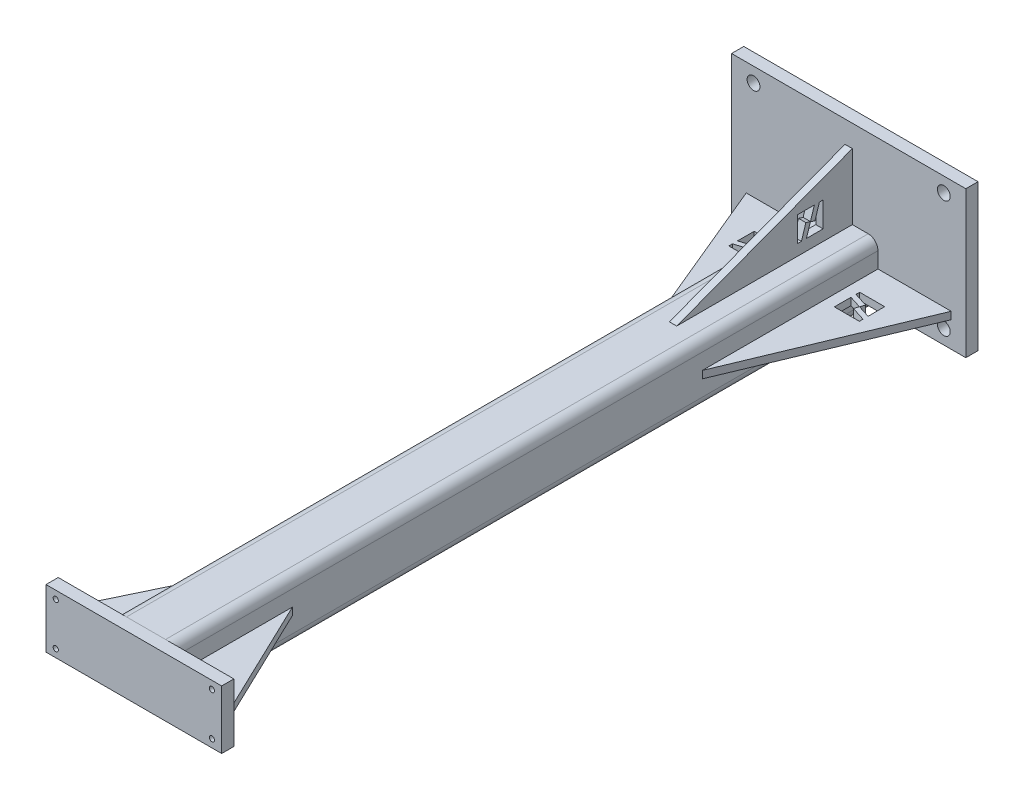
from build123d import *

# Parameters (mm, degrees)
TUBE_SQUARE_TS3X3X0_25_4_DEPTH   = 914.4
SKETCH12_W                       = 304.8
SKETCH12_H                       = 190.5
BOSS_EXTRUDE1_DEPTH              = 15.875
SKETCH14_W                       = 8.33374
SKETCH14_H                       = 15.875
F_5_8_CLEARANCE_HOLE1_AT_2_COUNT = 2
F_5_8_CLEARANCE_HOLE1_AT_2_PITCH = 152.4
F_5_8_CLEARANCE_HOLE1_AT_3_COUNT = 2
F_5_8_CLEARANCE_HOLE1_AT_3_PITCH = 290.785629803
F_5_8_CLEARANCE_HOLE1_AT_4_COUNT = 2
F_5_8_CLEARANCE_HOLE1_AT_4_PITCH = 247.65
GUSSET1_THICKNESS                = 9.525
CUT_EXTRUDE1_DEPTH               = 955.166739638
GUSSET2_THICKNESS                = 9.525
CUT_EXTRUDE2_DEPTH               = 956.686866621
SKETCH136_W                      = 228.6
SKETCH136_H                      = 76.2
BOSS_EXTRUDE2_DEPTH              = 15.875
SKETCH138_W                      = 3.3782
SKETCH138_H                      = 15.875
F_1_4_CLEARANCE_HOLE1_AT_2_COUNT = 2
F_1_4_CLEARANCE_HOLE1_AT_2_PITCH = 55.5498
MIRROR4_COPY_1_SKETCH_W          = 3.3782
MIRROR4_COPY_1_SKETCH_H          = 15.875
BOSS_EXTRUDE3_DEPTH              = 4.7625


with BuildPart() as part:
    # Sketch152 → Tube _square_ TS3X3X0.25_4 (new body)
    with BuildSketch(Plane(origin=(0, 0, 0), x_dir=(1, 0, 0), z_dir=(0, 0, -1))):
        with BuildLine():
            Line((-25.4, -38.1), (25.4, -38.1))
            ThreePointArc((25.4, -38.1), (34.380256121, -34.380256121), (38.1, -25.4))
            Line((38.1, -25.4), (38.1, 25.4))
            ThreePointArc((38.1, 25.4), (34.380256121, 34.380256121), (25.4, 38.1))
            Line((25.4, 38.1), (-25.4, 38.1))
            ThreePointArc((-25.4, 38.1), (-34.380256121, 34.380256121), (-38.1, 25.4))
            Line((-38.1, 25.4), (-38.1, -25.4))
            ThreePointArc((-38.1, -25.4), (-34.380256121, -34.380256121), (-25.4, -38.1))
        make_face()
        with BuildLine():
            Line((-25.4, -31.75), (25.4, -31.75))
            ThreePointArc((25.4, -31.75), (29.890128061, -29.890128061), (31.75, -25.4))
            Line((31.75, -25.4), (31.75, 25.4))
            ThreePointArc((31.75, 25.4), (29.890128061, 29.890128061), (25.4, 31.75))
            Line((25.4, 31.75), (-25.4, 31.75))
            ThreePointArc((-25.4, 31.75), (-29.890128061, 29.890128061), (-31.75, 25.4))
            Line((-31.75, 25.4), (-31.75, -25.4))
            ThreePointArc((-31.75, -25.4), (-29.890128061, -29.890128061), (-25.4, -31.75))
        make_face(mode=Mode.SUBTRACT)
    extrude(amount=TUBE_SQUARE_TS3X3X0_25_4_DEPTH)


with BuildPart() as body_2:
    # Sketch12 → Boss-Extrude1 (new body)
    with BuildSketch(Plane(origin=(0, 0, -914.4), x_dir=(-1, 0, 0), z_dir=(0, 0, -1))):
        with Locations((0, 57.15)):
            Rectangle(SKETCH12_W, SKETCH12_H)
    extrude(amount=BOSS_EXTRUDE1_DEPTH)

    # Sketch14 → 5_8 Clearance Hole1 (revolve, cut)
    with BuildSketch(Plane(origin=(-123.825, 133.35, -914.4), x_dir=(0, -1, 0), z_dir=(1, 0, 0))):
        with Locations((4.16687, 7.9375)):
            Rectangle(SKETCH14_W, SKETCH14_H)
    f_5_8_clearance_hole1 = revolve(axis=Axis((-123.825, 133.35, -908.05), (0, 0, -1)), mode=Mode.SUBTRACT)

    # 5_8 Clearance Hole1 at 2: 5_8 Clearance Hole1 ×2
    with Locations(*[(0, -i * F_5_8_CLEARANCE_HOLE1_AT_2_PITCH, 0) for i in range(1, F_5_8_CLEARANCE_HOLE1_AT_2_COUNT)]):
        add(f_5_8_clearance_hole1, mode=Mode.SUBTRACT)

    # 5_8 Clearance Hole1 at 3: 5_8 Clearance Hole1 ×2
    with Locations(*[Vector(0.8516583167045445, -0.5240974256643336, 0) * (i * F_5_8_CLEARANCE_HOLE1_AT_3_PITCH) for i in range(1, F_5_8_CLEARANCE_HOLE1_AT_3_COUNT)]):
        add(f_5_8_clearance_hole1, mode=Mode.SUBTRACT)

    # 5_8 Clearance Hole1 at 4: 5_8 Clearance Hole1 ×2
    with Locations(*[(i * F_5_8_CLEARANCE_HOLE1_AT_4_PITCH, 0, 0) for i in range(1, F_5_8_CLEARANCE_HOLE1_AT_4_COUNT)]):
        add(f_5_8_clearance_hole1, mode=Mode.SUBTRACT)


with BuildPart() as body_3:
    # Gusset1: a gusset: a plate 9.525 thick in the corner of two members, its outline drawn in place
    gusset1_outline = Wire([Line((-38.1, -4.7625, -914.4), (-38.1, -4.7625, -685.8)), Line((-38.1, -4.7625, -685.8), (-133.35, -4.7625, -914.4)), Line((-133.35, -4.7625, -914.4), (-38.1, -4.7625, -914.4))])
    add(extrude(Face(gusset1_outline), amount=GUSSET1_THICKNESS, dir=(0, 1, 0)))

    # Sketch134 → Cut-Extrude1 (cut, through all)
    with BuildSketch(Plane(origin=(0, 4.7625, 0), x_dir=(1, 0, 0), z_dir=(0, 1, 0))):
        Polygon((-68.510679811, 859.851672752), (-66.696592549, 853.869885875), (-84.937882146, 848.116464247), (-84.937882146, 843.321072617), (-52.3875, 843.321072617), (-52.3875, 864.976103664), align=None)
        Polygon((-68.829938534, 859.74597603), (-70.636407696, 865.727762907), (-52.3875, 871.481184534), (-52.3875, 876.3), (-84.929084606, 876.3), (-84.985949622, 854.633257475), align=None)
    extrude(amount=-CUT_EXTRUDE1_DEPTH, mode=Mode.SUBTRACT)


with BuildPart() as body_4:
    # Gusset2: a gusset: a plate 9.525 thick in the corner of two members, its outline drawn in place
    gusset2_outline = Wire([Line((-4.7625, 38.1, -914.4), (-4.7625, 38.1, -685.8)), Line((-4.7625, 38.1, -685.8), (-4.7625, 123.825, -914.4)), Line((-4.7625, 123.825, -914.4), (-4.7625, 38.1, -914.4))])
    add(extrude(Face(gusset2_outline), amount=GUSSET2_THICKNESS, dir=(1, 0, 0)))

    # Sketch135 → Cut-Extrude2 (cut, through all)
    with BuildSketch(Plane.ZY.offset(4.7625)):
        Polygon((-859.769399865, 68.510679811), (-865.751186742, 66.696592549), (-871.50460837, 84.937882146), (-876.3, 84.937882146), (-876.3, 52.3875), (-854.644968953, 52.3875), align=None)
        Polygon((-859.875096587, 68.829938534), (-853.89330971, 70.636407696), (-848.139888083, 52.3875), (-843.321072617, 52.3875), (-843.321072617, 84.929084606), (-864.987815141, 84.985949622), align=None)
    extrude(amount=-CUT_EXTRUDE2_DEPTH, mode=Mode.SUBTRACT)


with BuildPart() as body_5:
    # Mirror3: mirrored copy
    add(body_3.part.mirror(Plane.ZY))


with BuildPart() as body_6:
    # Sketch136 → Boss-Extrude2 (new body)
    with BuildSketch(Plane.XY):
        Rectangle(SKETCH136_W, SKETCH136_H)
    extrude(amount=BOSS_EXTRUDE2_DEPTH)

    # Sketch138 → 1_4 Clearance Hole1 (revolve, cut)
    with BuildSketch(Plane(origin=(-101.6, 27.7749, 0), x_dir=(0, 1, 0), z_dir=(1, 0, 0))):
        with Locations((1.6891, 7.9375)):
            Rectangle(SKETCH138_W, SKETCH138_H)
    f_1_4_clearance_hole1 = revolve(axis=Axis((-101.6, 27.7749, -6.35), (0, 0, 1)), mode=Mode.SUBTRACT)

    # 1_4 Clearance Hole1 at 2: 1_4 Clearance Hole1 ×2
    with Locations(*[(0, -i * F_1_4_CLEARANCE_HOLE1_AT_2_PITCH, 0) for i in range(1, F_1_4_CLEARANCE_HOLE1_AT_2_COUNT)]):
        add(f_1_4_clearance_hole1, mode=Mode.SUBTRACT)

    # Mirror4: 1_4 Clearance Hole1 across plane
    add(f_1_4_clearance_hole1.mirror(Plane.ZY), mode=Mode.SUBTRACT)

    # Mirror4 copy 1 sketch → Mirror4 copy 1 (revolve, cut)
    with BuildSketch(Plane(origin=(101.6, -27.7749, 0), x_dir=(0, 1, 0), z_dir=(-1, 0, 0))):
        with Locations((1.6891, -7.9375)):
            Rectangle(MIRROR4_COPY_1_SKETCH_W, MIRROR4_COPY_1_SKETCH_H)
    revolve(axis=Axis((101.6, -27.7749, -6.35), (0, 0, -1)), mode=Mode.SUBTRACT)


with BuildPart() as body_7:
    # Sketch139 → Boss-Extrude3 (new, symmetric)
    with BuildSketch(Plane(origin=(0, 0, 0), x_dir=(1, 0, 0), z_dir=(0, 1, 0))):
        Polygon((111.125, 0), (38.1, 152.4), (38.1, 0), align=None)
    extrude(amount=BOSS_EXTRUDE3_DEPTH, both=True)


with BuildPart() as body_8:
    # Mirror5: mirrored copy
    add(body_7.part.mirror(Plane.ZY))


solid = Compound([part.part, body_2.part, body_3.part, body_4.part, body_5.part, body_6.part, body_7.part, body_8.part])
